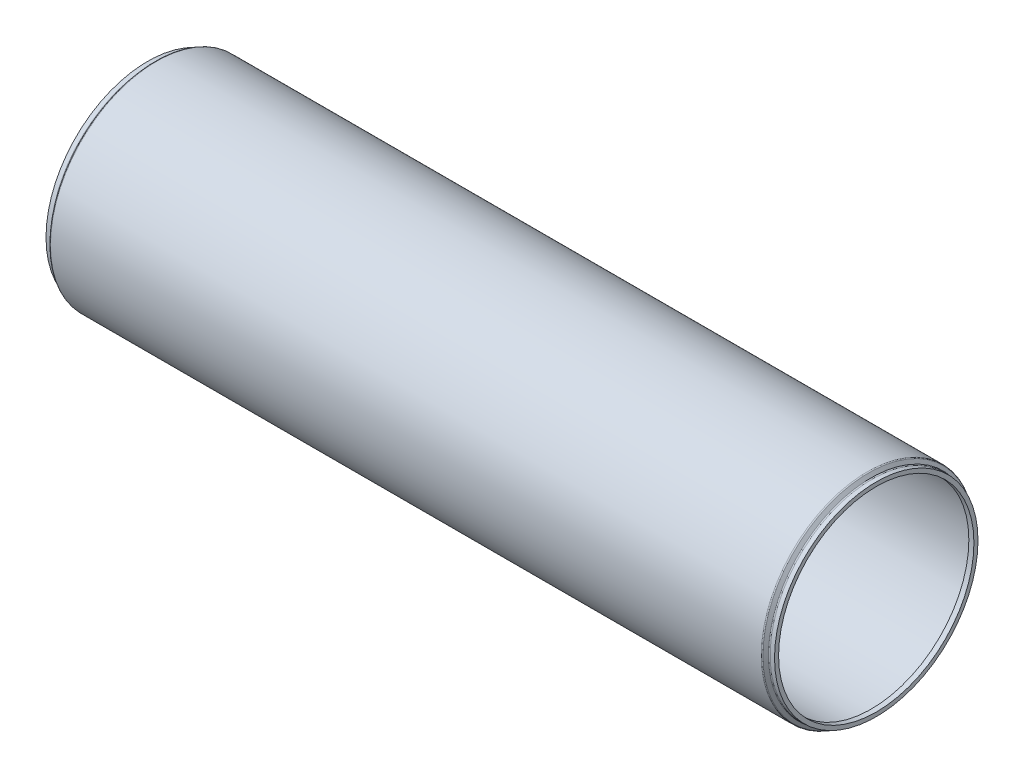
from build123d import *

# Parameters (mm, degrees)
SKETCH1_R            = 19.8755
SKETCH1_R_2          = 19.1135
EXTRUDE_THIN1_DEPTH  = 133.35
FILLET1_R            = 0.254
SKETCH3_R            = 19.05
SKETCH3_R_2          = 18.288
EXTRUDE1_DEPTH       = 0.762
FILLET1_OF_MIRROR2_R = 0.254


with BuildPart() as part:
    # Sketch1 → Extrude-Thin1 (new body)
    with BuildSketch(Plane(origin=(0, 0, 0), x_dir=(0, 0, -1), z_dir=(1, 0, 0))):
        Circle(SKETCH1_R)
        Circle(SKETCH1_R_2, mode=Mode.SUBTRACT)
    extrude(amount=EXTRUDE_THIN1_DEPTH)

    # Sketch2 → Revolve2 (revolve)
    with BuildSketch(Plane.XY, mode=Mode.PRIVATE) as revolve2_sk:
        Polygon((-0.762, 19.05), (-0.5715, 19.05), (0, 19.8755), (0, 19.1135), (-0.5715, 18.288), (-0.762, 18.288), align=None)
    revolve2 = revolve(revolve2_sk.sketch.rotate(Axis((133.35, 0, 0), (-1, 0, 0)), 90), axis=Axis((133.35, 0, 0), (-1, 0, 0)))

    # Fillet1
    fillet1_edges = [part.edges().sort_by_distance(p)[0] for p in [
        (0, 0, 19.8755),
        (-0.5715, 0, 19.05),
    ]]
    fillet(fillet1_edges, radius=FILLET1_R)

    # Sketch3 → Extrude1 (add)
    with BuildSketch(Plane.ZY.offset(0.762)):
        with Locations(Location((0, 0, 0), (0, 0, 180))):
            Circle(SKETCH3_R)
        with Locations(Location((0, 0, 0), (0, 0, 180))):
            Circle(SKETCH3_R_2, mode=Mode.SUBTRACT)
    extrude1 = extrude(amount=EXTRUDE1_DEPTH)

    # Mirror2: Revolve2, Extrude1 across plane
    add(revolve2.mirror(Plane(origin=(66.675, 0, 0), x_dir=(0, 0, 1), z_dir=(1, 0, 0))))
    add(extrude1.mirror(Plane(origin=(66.675, 0, 0), x_dir=(0, 0, 1), z_dir=(1, 0, 0))))

    # Fillet1 of Mirror2
    fillet1_of_mirror2_edges = [part.edges().sort_by_distance(p)[0] for p in [
        (133.35, 0, 19.8755),
        (133.9215, 0, 19.05),
    ]]
    fillet(fillet1_of_mirror2_edges, radius=FILLET1_OF_MIRROR2_R)


solid = part.part
